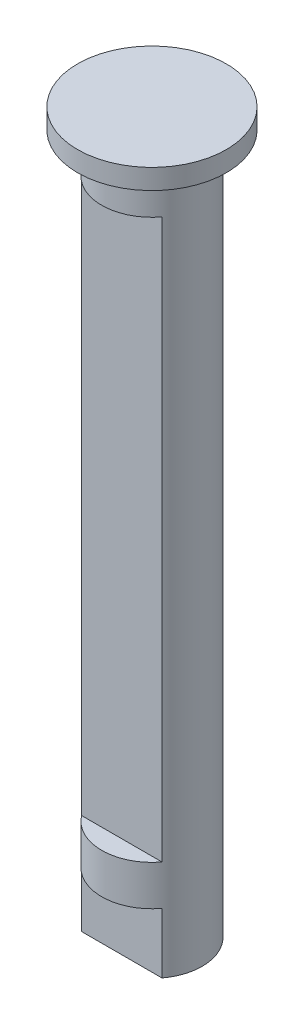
ISO-10303-21;
HEADER;
FILE_DESCRIPTION(('STEP AP214'),'2;1');
FILE_NAME('part.step','',(''),(''),'','','');
FILE_SCHEMA(('AUTOMOTIVE_DESIGN { 1 0 10303 214 1 1 1 1 }'));
ENDSEC;
DATA;
#1=APPLICATION_CONTEXT('core data for automotive mechanical design processes');
#2=APPLICATION_PROTOCOL_DEFINITION('international standard','automotive_design',2000,#1);
#3=PRODUCT_CONTEXT('',#1,'mechanical');
#4=PRODUCT('Part','Part','',(#3));
#5=PRODUCT_RELATED_PRODUCT_CATEGORY('part','',(#4));
#6=PRODUCT_DEFINITION_FORMATION('','',#4);
#7=PRODUCT_DEFINITION_CONTEXT('part definition',#1,'design');
#8=PRODUCT_DEFINITION('design','',#6,#7);
#9=PRODUCT_DEFINITION_SHAPE('','',#8);
#10=(LENGTH_UNIT() NAMED_UNIT(*) SI_UNIT(.MILLI.,.METRE.));
#11=(NAMED_UNIT(*) PLANE_ANGLE_UNIT() SI_UNIT($,.RADIAN.));
#12=(NAMED_UNIT(*) SI_UNIT($,.STERADIAN.) SOLID_ANGLE_UNIT());
#13=UNCERTAINTY_MEASURE_WITH_UNIT(LENGTH_MEASURE(1.E-05),#10,'distance_accuracy_value','');
#14=(GEOMETRIC_REPRESENTATION_CONTEXT(3) GLOBAL_UNCERTAINTY_ASSIGNED_CONTEXT((#13)) GLOBAL_UNIT_ASSIGNED_CONTEXT((#10,
#11,#12)) REPRESENTATION_CONTEXT('',''));
#15=CARTESIAN_POINT('',(0.,0.,0.));
#16=DIRECTION('',(0.,0.,1.));
#17=DIRECTION('',(1.,0.,0.));
#18=AXIS2_PLACEMENT_3D('',#15,#16,#17);
#19=CARTESIAN_POINT('',(0.,27.8,0.));
#20=DIRECTION('',(0.,-1.,0.));
#21=DIRECTION('',(0.,0.,-1.));
#22=AXIS2_PLACEMENT_3D('',#19,#20,#21);
#23=CYLINDRICAL_SURFACE('',#22,2.5);
#24=DIRECTION('',(0.,-1.,0.));
#25=VECTOR('',#24,1.);
#26=CARTESIAN_POINT('',(2.,27.8,1.5));
#27=LINE('',#26,#25);
#28=CARTESIAN_POINT('',(2.,27.8,1.5));
#29=VERTEX_POINT('',#28);
#30=CARTESIAN_POINT('',(2.,0.,1.5));
#31=VERTEX_POINT('',#30);
#32=EDGE_CURVE('E51',#29,#31,#27,.T.);
#33=ORIENTED_EDGE('',*,*,#32,.T.);
#34=CARTESIAN_POINT('',(0.,0.,0.));
#35=DIRECTION('',(0.,-1.,0.));
#36=DIRECTION('',(0.,0.,-1.));
#37=AXIS2_PLACEMENT_3D('',#34,#35,#36);
#38=CIRCLE('',#37,2.5);
#39=CARTESIAN_POINT('',(-2.,0.,1.5));
#40=VERTEX_POINT('',#39);
#41=EDGE_CURVE('E102',#31,#40,#38,.T.);
#42=ORIENTED_EDGE('',*,*,#41,.T.);
#43=DIRECTION('',(0.,-1.,0.));
#44=VECTOR('',#43,1.);
#45=CARTESIAN_POINT('',(-2.,27.8,1.5));
#46=LINE('',#45,#44);
#47=CARTESIAN_POINT('',(-2.,27.8,1.5));
#48=VERTEX_POINT('',#47);
#49=EDGE_CURVE('E11',#48,#40,#46,.T.);
#50=ORIENTED_EDGE('',*,*,#49,.F.);
#51=CARTESIAN_POINT('',(0.,27.8,0.));
#52=DIRECTION('',(0.,1.,0.));
#53=DIRECTION('',(0.,0.,1.));
#54=AXIS2_PLACEMENT_3D('',#51,#52,#53);
#55=CIRCLE('',#54,2.5);
#56=EDGE_CURVE('E119',#48,#29,#55,.T.);
#57=ORIENTED_EDGE('',*,*,#56,.T.);
#58=EDGE_LOOP('',(#33,#42,#50,#57));
#59=FACE_BOUND('',#58,.T.);
#60=CARTESIAN_POINT('',(0.,29.8,0.));
#61=DIRECTION('',(0.,1.,0.));
#62=DIRECTION('',(0.,0.,1.));
#63=AXIS2_PLACEMENT_3D('',#60,#61,#62);
#64=CIRCLE('',#63,2.5);
#65=CARTESIAN_POINT('',(0.,29.8,2.5));
#66=VERTEX_POINT('',#65);
#67=EDGE_CURVE('E123',#66,#66,#64,.T.);
#68=ORIENTED_EDGE('',*,*,#67,.F.);
#69=EDGE_LOOP('',(#68));
#70=FACE_BOUND('',#69,.T.);
#71=CARTESIAN_POINT('',(0.,-2.,0.));
#72=DIRECTION('',(0.,-1.,0.));
#73=DIRECTION('',(0.,0.,-1.));
#74=AXIS2_PLACEMENT_3D('',#71,#72,#73);
#75=CIRCLE('',#74,2.5);
#76=CARTESIAN_POINT('',(2.,-2.,1.5));
#77=VERTEX_POINT('',#76);
#78=CARTESIAN_POINT('',(-2.,-2.,1.5));
#79=VERTEX_POINT('',#78);
#80=EDGE_CURVE('E100',#77,#79,#75,.T.);
#81=ORIENTED_EDGE('',*,*,#80,.F.);
#82=DIRECTION('',(0.,1.,0.));
#83=VECTOR('',#82,1.);
#84=CARTESIAN_POINT('',(2.,-5.,1.5));
#85=LINE('',#84,#83);
#86=CARTESIAN_POINT('',(2.,-5.,1.5));
#87=VERTEX_POINT('',#86);
#88=EDGE_CURVE('E88',#87,#77,#85,.T.);
#89=ORIENTED_EDGE('',*,*,#88,.F.);
#90=CARTESIAN_POINT('',(0.,-5.,0.));
#91=DIRECTION('',(0.,-1.,0.));
#92=DIRECTION('',(0.,0.,-1.));
#93=AXIS2_PLACEMENT_3D('',#90,#91,#92);
#94=CIRCLE('',#93,2.5);
#95=CARTESIAN_POINT('',(-2.,-5.,1.5));
#96=VERTEX_POINT('',#95);
#97=EDGE_CURVE('E94',#96,#87,#94,.T.);
#98=ORIENTED_EDGE('',*,*,#97,.F.);
#99=DIRECTION('',(0.,1.,0.));
#100=VECTOR('',#99,1.);
#101=CARTESIAN_POINT('',(-2.,-5.,1.5));
#102=LINE('',#101,#100);
#103=EDGE_CURVE('E90',#96,#79,#102,.T.);
#104=ORIENTED_EDGE('',*,*,#103,.T.);
#105=EDGE_LOOP('',(#81,#89,#98,#104));
#106=FACE_BOUND('',#105,.T.);
#107=ADVANCED_FACE('F43',(#59,#70,#106),#23,.T.);
#108=CARTESIAN_POINT('',(-2.,27.8,1.5));
#109=DIRECTION('',(0.,0.,-1.));
#110=DIRECTION('',(-1.,0.,0.));
#111=AXIS2_PLACEMENT_3D('',#108,#109,#110);
#112=PLANE('',#111);
#113=DIRECTION('',(1.,0.,0.));
#114=VECTOR('',#113,1.);
#115=CARTESIAN_POINT('',(-2.,0.,1.5));
#116=LINE('',#115,#114);
#117=EDGE_CURVE('E127',#40,#31,#116,.T.);
#118=ORIENTED_EDGE('',*,*,#117,.T.);
#119=ORIENTED_EDGE('',*,*,#32,.F.);
#120=DIRECTION('',(1.,0.,0.));
#121=VECTOR('',#120,1.);
#122=CARTESIAN_POINT('',(-2.,27.8,1.5));
#123=LINE('',#122,#121);
#124=EDGE_CURVE('E65',#48,#29,#123,.T.);
#125=ORIENTED_EDGE('',*,*,#124,.F.);
#126=ORIENTED_EDGE('',*,*,#49,.T.);
#127=EDGE_LOOP('',(#118,#119,#125,#126));
#128=FACE_BOUND('',#127,.T.);
#129=ADVANCED_FACE('F141',(#128),#112,.F.);
#130=CARTESIAN_POINT('',(0.,27.8,0.));
#131=DIRECTION('',(0.,1.,0.));
#132=DIRECTION('',(0.,0.,1.));
#133=AXIS2_PLACEMENT_3D('',#130,#131,#132);
#134=PLANE('',#133);
#135=ORIENTED_EDGE('',*,*,#56,.F.);
#136=ORIENTED_EDGE('',*,*,#124,.T.);
#137=EDGE_LOOP('',(#135,#136));
#138=FACE_BOUND('',#137,.T.);
#139=ADVANCED_FACE('F143',(#138),#134,.F.);
#140=CARTESIAN_POINT('',(0.,30.8,0.));
#141=DIRECTION('',(0.,-1.,0.));
#142=DIRECTION('',(0.,0.,-1.));
#143=AXIS2_PLACEMENT_3D('',#140,#141,#142);
#144=CYLINDRICAL_SURFACE('',#143,3.7);
#145=CARTESIAN_POINT('',(0.,30.8,0.));
#146=DIRECTION('',(0.,1.,0.));
#147=DIRECTION('',(0.,0.,1.));
#148=AXIS2_PLACEMENT_3D('',#145,#146,#147);
#149=CIRCLE('',#148,3.7);
#150=CARTESIAN_POINT('',(0.,30.8,3.7));
#151=VERTEX_POINT('',#150);
#152=EDGE_CURVE('E115',#151,#151,#149,.T.);
#153=ORIENTED_EDGE('',*,*,#152,.F.);
#154=EDGE_LOOP('',(#153));
#155=FACE_BOUND('',#154,.T.);
#156=CARTESIAN_POINT('',(0.,29.8,0.));
#157=DIRECTION('',(0.,1.,0.));
#158=DIRECTION('',(0.,0.,1.));
#159=AXIS2_PLACEMENT_3D('',#156,#157,#158);
#160=CIRCLE('',#159,3.7);
#161=CARTESIAN_POINT('',(0.,29.8,3.7));
#162=VERTEX_POINT('',#161);
#163=EDGE_CURVE('E113',#162,#162,#160,.T.);
#164=ORIENTED_EDGE('',*,*,#163,.T.);
#165=EDGE_LOOP('',(#164));
#166=FACE_BOUND('',#165,.T.);
#167=ADVANCED_FACE('F145',(#155,#166),#144,.T.);
#168=CARTESIAN_POINT('',(0.,30.8,0.));
#169=DIRECTION('',(0.,1.,0.));
#170=DIRECTION('',(0.,0.,1.));
#171=AXIS2_PLACEMENT_3D('',#168,#169,#170);
#172=PLANE('',#171);
#173=ORIENTED_EDGE('',*,*,#152,.T.);
#174=EDGE_LOOP('',(#173));
#175=FACE_BOUND('',#174,.T.);
#176=ADVANCED_FACE('F151',(#175),#172,.T.);
#177=CARTESIAN_POINT('',(0.,29.8,0.));
#178=DIRECTION('',(0.,1.,0.));
#179=DIRECTION('',(0.,0.,1.));
#180=AXIS2_PLACEMENT_3D('',#177,#178,#179);
#181=PLANE('',#180);
#182=ORIENTED_EDGE('',*,*,#67,.T.);
#183=EDGE_LOOP('',(#182));
#184=FACE_BOUND('',#183,.T.);
#185=ORIENTED_EDGE('',*,*,#163,.F.);
#186=EDGE_LOOP('',(#185));
#187=FACE_BOUND('',#186,.T.);
#188=ADVANCED_FACE('F177',(#184,#187),#181,.F.);
#189=CARTESIAN_POINT('',(0.,-2.,0.));
#190=DIRECTION('',(0.,-1.,0.));
#191=DIRECTION('',(0.,0.,-1.));
#192=AXIS2_PLACEMENT_3D('',#189,#190,#191);
#193=PLANE('',#192);
#194=DIRECTION('',(-1.,0.,0.));
#195=VECTOR('',#194,1.);
#196=CARTESIAN_POINT('',(-2.,-2.,1.5));
#197=LINE('',#196,#195);
#198=EDGE_CURVE('E57',#77,#79,#197,.T.);
#199=ORIENTED_EDGE('',*,*,#198,.F.);
#200=ORIENTED_EDGE('',*,*,#80,.T.);
#201=EDGE_LOOP('',(#199,#200));
#202=FACE_BOUND('',#201,.T.);
#203=ADVANCED_FACE('F185',(#202),#193,.T.);
#204=CARTESIAN_POINT('',(0.,0.,0.));
#205=DIRECTION('',(0.,-1.,0.));
#206=DIRECTION('',(0.,0.,-1.));
#207=AXIS2_PLACEMENT_3D('',#204,#205,#206);
#208=PLANE('',#207);
#209=ORIENTED_EDGE('',*,*,#117,.F.);
#210=ORIENTED_EDGE('',*,*,#41,.F.);
#211=EDGE_LOOP('',(#209,#210));
#212=FACE_BOUND('',#211,.T.);
#213=ADVANCED_FACE('F194',(#212),#208,.F.);
#214=CARTESIAN_POINT('',(-2.,-5.,1.5));
#215=DIRECTION('',(0.,0.,-1.));
#216=DIRECTION('',(-1.,0.,0.));
#217=AXIS2_PLACEMENT_3D('',#214,#215,#216);
#218=PLANE('',#217);
#219=ORIENTED_EDGE('',*,*,#198,.T.);
#220=ORIENTED_EDGE('',*,*,#103,.F.);
#221=DIRECTION('',(-1.,0.,0.));
#222=VECTOR('',#221,1.);
#223=CARTESIAN_POINT('',(-2.,-5.,1.5));
#224=LINE('',#223,#222);
#225=EDGE_CURVE('E84',#87,#96,#224,.T.);
#226=ORIENTED_EDGE('',*,*,#225,.F.);
#227=ORIENTED_EDGE('',*,*,#88,.T.);
#228=EDGE_LOOP('',(#219,#220,#226,#227));
#229=FACE_BOUND('',#228,.T.);
#230=ADVANCED_FACE('F86',(#229),#218,.F.);
#231=CARTESIAN_POINT('',(0.,-5.,0.));
#232=DIRECTION('',(0.,-1.,0.));
#233=DIRECTION('',(0.,0.,-1.));
#234=AXIS2_PLACEMENT_3D('',#231,#232,#233);
#235=PLANE('',#234);
#236=ORIENTED_EDGE('',*,*,#97,.T.);
#237=ORIENTED_EDGE('',*,*,#225,.T.);
#238=EDGE_LOOP('',(#236,#237));
#239=FACE_BOUND('',#238,.T.);
#240=ADVANCED_FACE('F96',(#239),#235,.T.);
#241=CLOSED_SHELL('',(#107,#129,#139,#167,#176,#188,#203,#213,#230,#240));
#242=MANIFOLD_SOLID_BREP('B2',#241);
#243=ADVANCED_BREP_SHAPE_REPRESENTATION('',(#18,#242),#14);
#244=SHAPE_DEFINITION_REPRESENTATION(#9,#243);
ENDSEC;
END-ISO-10303-21;
